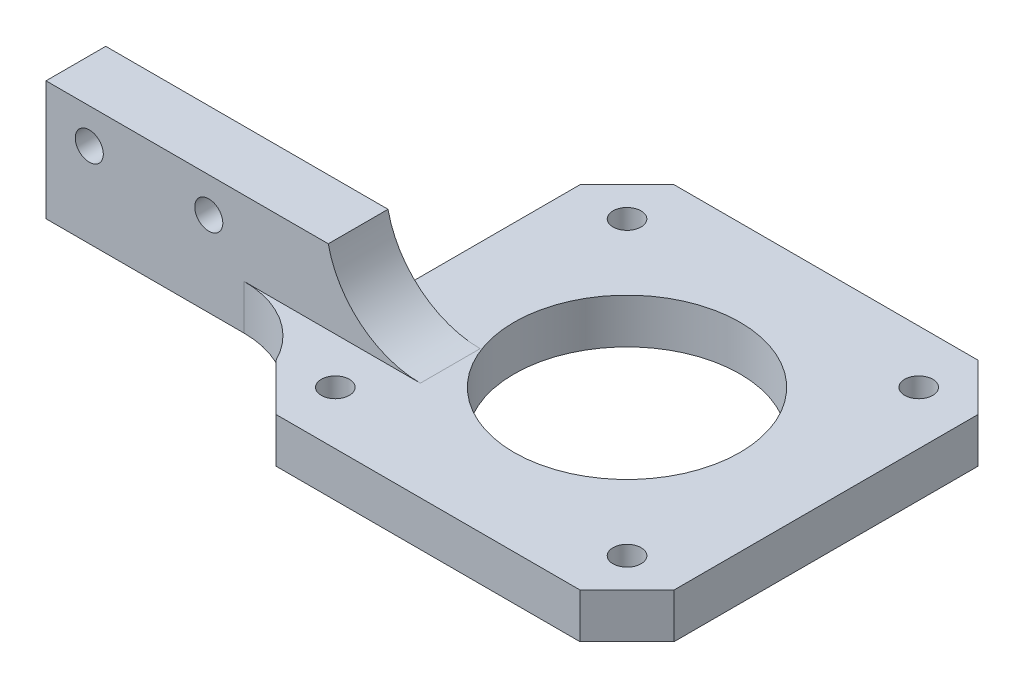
ISO-10303-21;
HEADER;
FILE_DESCRIPTION(('STEP AP214'),'2;1');
FILE_NAME('part.step','',(''),(''),'','','');
FILE_SCHEMA(('AUTOMOTIVE_DESIGN { 1 0 10303 214 1 1 1 1 }'));
ENDSEC;
DATA;
#1=APPLICATION_CONTEXT('core data for automotive mechanical design processes');
#2=APPLICATION_PROTOCOL_DEFINITION('international standard','automotive_design',2000,#1);
#3=PRODUCT_CONTEXT('',#1,'mechanical');
#4=PRODUCT('Part','Part','',(#3));
#5=PRODUCT_RELATED_PRODUCT_CATEGORY('part','',(#4));
#6=PRODUCT_DEFINITION_FORMATION('','',#4);
#7=PRODUCT_DEFINITION_CONTEXT('part definition',#1,'design');
#8=PRODUCT_DEFINITION('design','',#6,#7);
#9=PRODUCT_DEFINITION_SHAPE('','',#8);
#10=(LENGTH_UNIT() NAMED_UNIT(*) SI_UNIT(.MILLI.,.METRE.));
#11=(NAMED_UNIT(*) PLANE_ANGLE_UNIT() SI_UNIT($,.RADIAN.));
#12=(NAMED_UNIT(*) SI_UNIT($,.STERADIAN.) SOLID_ANGLE_UNIT());
#13=UNCERTAINTY_MEASURE_WITH_UNIT(LENGTH_MEASURE(1.E-05),#10,'distance_accuracy_value','');
#14=(GEOMETRIC_REPRESENTATION_CONTEXT(3) GLOBAL_UNCERTAINTY_ASSIGNED_CONTEXT((#13)) GLOBAL_UNIT_ASSIGNED_CONTEXT((#10,
#11,#12)) REPRESENTATION_CONTEXT('',''));
#15=CARTESIAN_POINT('',(0.,0.,0.));
#16=DIRECTION('',(0.,0.,1.));
#17=DIRECTION('',(1.,0.,0.));
#18=AXIS2_PLACEMENT_3D('',#15,#16,#17);
#19=CARTESIAN_POINT('',(-21.15,4.7625,-16.15));
#20=DIRECTION('',(1.,0.,0.));
#21=DIRECTION('',(0.,0.,-1.));
#22=AXIS2_PLACEMENT_3D('',#19,#20,#21);
#23=PLANE('',#22);
#24=DIRECTION('',(0.,-1.,0.));
#25=VECTOR('',#24,1.);
#26=CARTESIAN_POINT('',(-21.15,0.,4.2499999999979));
#27=LINE('',#26,#25);
#28=CARTESIAN_POINT('',(-21.15,4.7625,4.2499999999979));
#29=VERTEX_POINT('',#28);
#30=CARTESIAN_POINT('',(-21.15,0.,4.2499999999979));
#31=VERTEX_POINT('',#30);
#32=EDGE_CURVE('E174',#29,#31,#27,.T.);
#33=ORIENTED_EDGE('',*,*,#32,.F.);
#34=DIRECTION('',(0.,0.,1.));
#35=VECTOR('',#34,1.);
#36=CARTESIAN_POINT('',(-21.15,4.7625,-16.15));
#37=LINE('',#36,#35);
#38=CARTESIAN_POINT('',(-21.15,4.7625,-16.15));
#39=VERTEX_POINT('',#38);
#40=EDGE_CURVE('E223',#39,#29,#37,.T.);
#41=ORIENTED_EDGE('',*,*,#40,.F.);
#42=DIRECTION('',(0.,-1.,0.));
#43=VECTOR('',#42,1.);
#44=CARTESIAN_POINT('',(-21.15,4.7625,-16.15));
#45=LINE('',#44,#43);
#46=CARTESIAN_POINT('',(-21.15,0.,-16.15));
#47=VERTEX_POINT('',#46);
#48=EDGE_CURVE('E252',#39,#47,#45,.T.);
#49=ORIENTED_EDGE('',*,*,#48,.T.);
#50=DIRECTION('',(0.,0.,1.));
#51=VECTOR('',#50,1.);
#52=CARTESIAN_POINT('',(-21.15,0.,-16.15));
#53=LINE('',#52,#51);
#54=EDGE_CURVE('E240',#47,#31,#53,.T.);
#55=ORIENTED_EDGE('',*,*,#54,.T.);
#56=EDGE_LOOP('',(#33,#41,#49,#55));
#57=FACE_BOUND('',#56,.T.);
#58=ADVANCED_FACE('F45',(#57),#23,.F.);
#59=CARTESIAN_POINT('',(0.,4.7625,0.));
#60=DIRECTION('',(0.,1.,0.));
#61=DIRECTION('',(0.,0.,1.));
#62=AXIS2_PLACEMENT_3D('',#59,#60,#61);
#63=PLANE('',#62);
#64=CARTESIAN_POINT('',(15.5,4.7625,15.5));
#65=DIRECTION('',(0.,1.,0.));
#66=DIRECTION('',(0.,0.,1.));
#67=AXIS2_PLACEMENT_3D('',#64,#65,#66);
#68=CIRCLE('',#67,1.49);
#69=CARTESIAN_POINT('',(15.5,4.7625,14.01));
#70=VERTEX_POINT('',#69);
#71=EDGE_CURVE('E187',#70,#70,#68,.T.);
#72=ORIENTED_EDGE('',*,*,#71,.F.);
#73=EDGE_LOOP('',(#72));
#74=FACE_BOUND('',#73,.T.);
#75=CARTESIAN_POINT('',(-15.5,4.7625,-15.5));
#76=DIRECTION('',(0.,1.,0.));
#77=DIRECTION('',(0.,0.,1.));
#78=AXIS2_PLACEMENT_3D('',#75,#76,#77);
#79=CIRCLE('',#78,1.49);
#80=CARTESIAN_POINT('',(-15.5,4.7625,-16.99));
#81=VERTEX_POINT('',#80);
#82=EDGE_CURVE('E199',#81,#81,#79,.T.);
#83=ORIENTED_EDGE('',*,*,#82,.F.);
#84=EDGE_LOOP('',(#83));
#85=FACE_BOUND('',#84,.T.);
#86=DIRECTION('',(0.,0.,1.));
#87=VECTOR('',#86,1.);
#88=CARTESIAN_POINT('',(-11.3650067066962,4.7625,10.5999999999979));
#89=LINE('',#88,#87);
#90=CARTESIAN_POINT('',(-11.3650067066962,4.7625,4.2499999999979));
#91=VERTEX_POINT('',#90);
#92=CARTESIAN_POINT('',(-11.3650067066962,4.7625,10.5999999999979));
#93=VERTEX_POINT('',#92);
#94=EDGE_CURVE('E275',#91,#93,#89,.T.);
#95=ORIENTED_EDGE('',*,*,#94,.T.);
#96=DIRECTION('',(1.,0.,0.));
#97=VECTOR('',#96,1.);
#98=CARTESIAN_POINT('',(-51.15,4.7625,10.5999999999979));
#99=LINE('',#98,#97);
#100=CARTESIAN_POINT('',(-30.1053056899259,4.7625,10.5999999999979));
#101=VERTEX_POINT('',#100);
#102=EDGE_CURVE('E69',#101,#93,#99,.T.);
#103=ORIENTED_EDGE('',*,*,#102,.F.);
#104=CARTESIAN_POINT('',(-30.1053056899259,4.7625,20.5999999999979));
#105=DIRECTION('',(0.,1.,0.));
#106=DIRECTION('',(0.,0.,1.));
#107=AXIS2_PLACEMENT_3D('',#104,#105,#106);
#108=CIRCLE('',#107,10.);
#109=CARTESIAN_POINT('',(-21.15,4.7625,16.15));
#110=VERTEX_POINT('',#109);
#111=EDGE_CURVE('E270',#101,#110,#108,.F.);
#112=ORIENTED_EDGE('',*,*,#111,.T.);
#113=DIRECTION('',(0.707106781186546,0.,0.707106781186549));
#114=VECTOR('',#113,1.);
#115=CARTESIAN_POINT('',(-21.15,4.7625,16.15));
#116=LINE('',#115,#114);
#117=CARTESIAN_POINT('',(-16.15,4.7625,21.15));
#118=VERTEX_POINT('',#117);
#119=EDGE_CURVE('E225',#110,#118,#116,.T.);
#120=ORIENTED_EDGE('',*,*,#119,.T.);
#121=DIRECTION('',(1.,0.,0.));
#122=VECTOR('',#121,1.);
#123=CARTESIAN_POINT('',(-16.15,4.7625,21.15));
#124=LINE('',#123,#122);
#125=CARTESIAN_POINT('',(16.15,4.7625,21.15));
#126=VERTEX_POINT('',#125);
#127=EDGE_CURVE('E227',#118,#126,#124,.T.);
#128=ORIENTED_EDGE('',*,*,#127,.T.);
#129=DIRECTION('',(0.707106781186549,0.,-0.707106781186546));
#130=VECTOR('',#129,1.);
#131=CARTESIAN_POINT('',(16.15,4.7625,21.15));
#132=LINE('',#131,#130);
#133=CARTESIAN_POINT('',(21.15,4.7625,16.15));
#134=VERTEX_POINT('',#133);
#135=EDGE_CURVE('E211',#126,#134,#132,.T.);
#136=ORIENTED_EDGE('',*,*,#135,.T.);
#137=DIRECTION('',(0.,0.,-1.));
#138=VECTOR('',#137,1.);
#139=CARTESIAN_POINT('',(21.15,4.7625,16.15));
#140=LINE('',#139,#138);
#141=CARTESIAN_POINT('',(21.15,4.7625,-16.15));
#142=VERTEX_POINT('',#141);
#143=EDGE_CURVE('E214',#134,#142,#140,.T.);
#144=ORIENTED_EDGE('',*,*,#143,.T.);
#145=DIRECTION('',(-0.707106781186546,0.,-0.707106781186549));
#146=VECTOR('',#145,1.);
#147=CARTESIAN_POINT('',(21.15,4.7625,-16.15));
#148=LINE('',#147,#146);
#149=CARTESIAN_POINT('',(16.15,4.7625,-21.15));
#150=VERTEX_POINT('',#149);
#151=EDGE_CURVE('E217',#142,#150,#148,.T.);
#152=ORIENTED_EDGE('',*,*,#151,.T.);
#153=DIRECTION('',(-1.,0.,0.));
#154=VECTOR('',#153,1.);
#155=CARTESIAN_POINT('',(16.15,4.7625,-21.15));
#156=LINE('',#155,#154);
#157=CARTESIAN_POINT('',(-16.15,4.7625,-21.15));
#158=VERTEX_POINT('',#157);
#159=EDGE_CURVE('E219',#150,#158,#156,.T.);
#160=ORIENTED_EDGE('',*,*,#159,.T.);
#161=DIRECTION('',(-0.707106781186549,0.,0.707106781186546));
#162=VECTOR('',#161,1.);
#163=CARTESIAN_POINT('',(-16.15,4.7625,-21.15));
#164=LINE('',#163,#162);
#165=EDGE_CURVE('E221',#158,#39,#164,.T.);
#166=ORIENTED_EDGE('',*,*,#165,.T.);
#167=ORIENTED_EDGE('',*,*,#40,.T.);
#168=DIRECTION('',(1.,0.,0.));
#169=VECTOR('',#168,1.);
#170=CARTESIAN_POINT('',(0.,4.7625,4.2499999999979));
#171=LINE('',#170,#169);
#172=EDGE_CURVE('E61',#29,#91,#171,.T.);
#173=ORIENTED_EDGE('',*,*,#172,.T.);
#174=EDGE_LOOP('',(#95,#103,#112,#120,#128,#136,#144,#152,#160,#166,#167,#173));
#175=FACE_BOUND('',#174,.T.);
#176=CARTESIAN_POINT('',(0.,4.7625,0.));
#177=DIRECTION('',(0.,1.,0.));
#178=DIRECTION('',(0.,0.,1.));
#179=AXIS2_PLACEMENT_3D('',#176,#177,#178);
#180=CIRCLE('',#179,12.);
#181=CARTESIAN_POINT('',(0.,4.7625,-12.));
#182=VERTEX_POINT('',#181);
#183=EDGE_CURVE('E205',#182,#182,#180,.T.);
#184=ORIENTED_EDGE('',*,*,#183,.F.);
#185=EDGE_LOOP('',(#184));
#186=FACE_BOUND('',#185,.T.);
#187=CARTESIAN_POINT('',(15.5,4.7625,-15.5));
#188=DIRECTION('',(0.,1.,0.));
#189=DIRECTION('',(0.,0.,1.));
#190=AXIS2_PLACEMENT_3D('',#187,#188,#189);
#191=CIRCLE('',#190,1.49);
#192=CARTESIAN_POINT('',(15.5,4.7625,-16.99));
#193=VERTEX_POINT('',#192);
#194=EDGE_CURVE('E193',#193,#193,#191,.T.);
#195=ORIENTED_EDGE('',*,*,#194,.F.);
#196=EDGE_LOOP('',(#195));
#197=FACE_BOUND('',#196,.T.);
#198=CARTESIAN_POINT('',(-15.5,4.7625,15.5));
#199=DIRECTION('',(0.,1.,0.));
#200=DIRECTION('',(0.,0.,1.));
#201=AXIS2_PLACEMENT_3D('',#198,#199,#200);
#202=CIRCLE('',#201,1.49);
#203=CARTESIAN_POINT('',(-15.5,4.7625,14.01));
#204=VERTEX_POINT('',#203);
#205=EDGE_CURVE('E178',#204,#204,#202,.T.);
#206=ORIENTED_EDGE('',*,*,#205,.F.);
#207=EDGE_LOOP('',(#206));
#208=FACE_BOUND('',#207,.T.);
#209=ADVANCED_FACE('F306',(#74,#85,#175,#186,#197,#208),#63,.T.);
#210=CARTESIAN_POINT('',(0.,0.,0.));
#211=DIRECTION('',(0.,1.,0.));
#212=DIRECTION('',(0.,0.,1.));
#213=AXIS2_PLACEMENT_3D('',#210,#211,#212);
#214=PLANE('',#213);
#215=DIRECTION('',(0.707106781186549,0.,-0.707106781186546));
#216=VECTOR('',#215,1.);
#217=CARTESIAN_POINT('',(16.15,0.,21.15));
#218=LINE('',#217,#216);
#219=CARTESIAN_POINT('',(16.15,0.,21.15));
#220=VERTEX_POINT('',#219);
#221=CARTESIAN_POINT('',(21.15,0.,16.15));
#222=VERTEX_POINT('',#221);
#223=EDGE_CURVE('E208',#220,#222,#218,.T.);
#224=ORIENTED_EDGE('',*,*,#223,.F.);
#225=DIRECTION('',(1.,0.,0.));
#226=VECTOR('',#225,1.);
#227=CARTESIAN_POINT('',(-16.15,0.,21.15));
#228=LINE('',#227,#226);
#229=CARTESIAN_POINT('',(-16.15,0.,21.15));
#230=VERTEX_POINT('',#229);
#231=EDGE_CURVE('E215',#230,#220,#228,.T.);
#232=ORIENTED_EDGE('',*,*,#231,.F.);
#233=DIRECTION('',(0.707106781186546,0.,0.707106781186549));
#234=VECTOR('',#233,1.);
#235=CARTESIAN_POINT('',(-21.15,0.,16.15));
#236=LINE('',#235,#234);
#237=CARTESIAN_POINT('',(-21.15,0.,16.15));
#238=VERTEX_POINT('',#237);
#239=EDGE_CURVE('E242',#238,#230,#236,.T.);
#240=ORIENTED_EDGE('',*,*,#239,.F.);
#241=CARTESIAN_POINT('',(-30.1053056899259,0.,20.5999999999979));
#242=DIRECTION('',(0.,1.,0.));
#243=DIRECTION('',(0.,0.,1.));
#244=AXIS2_PLACEMENT_3D('',#241,#242,#243);
#245=CIRCLE('',#244,10.);
#246=CARTESIAN_POINT('',(-30.1053056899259,0.,10.5999999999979));
#247=VERTEX_POINT('',#246);
#248=EDGE_CURVE('E272',#238,#247,#245,.T.);
#249=ORIENTED_EDGE('',*,*,#248,.T.);
#250=DIRECTION('',(1.,0.,0.));
#251=VECTOR('',#250,1.);
#252=CARTESIAN_POINT('',(-51.15,0.,10.5999999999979));
#253=LINE('',#252,#251);
#254=CARTESIAN_POINT('',(-51.15,0.,10.5999999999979));
#255=VERTEX_POINT('',#254);
#256=EDGE_CURVE('E158',#255,#247,#253,.T.);
#257=ORIENTED_EDGE('',*,*,#256,.F.);
#258=DIRECTION('',(0.,0.,1.));
#259=VECTOR('',#258,1.);
#260=CARTESIAN_POINT('',(-51.15,0.,4.2499999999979));
#261=LINE('',#260,#259);
#262=CARTESIAN_POINT('',(-51.15,0.,4.2499999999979));
#263=VERTEX_POINT('',#262);
#264=EDGE_CURVE('E149',#263,#255,#261,.T.);
#265=ORIENTED_EDGE('',*,*,#264,.F.);
#266=DIRECTION('',(1.,0.,0.));
#267=VECTOR('',#266,1.);
#268=CARTESIAN_POINT('',(-51.15,0.,4.2499999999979));
#269=LINE('',#268,#267);
#270=EDGE_CURVE('E156',#263,#31,#269,.T.);
#271=ORIENTED_EDGE('',*,*,#270,.T.);
#272=ORIENTED_EDGE('',*,*,#54,.F.);
#273=DIRECTION('',(-0.707106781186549,0.,0.707106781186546));
#274=VECTOR('',#273,1.);
#275=CARTESIAN_POINT('',(-16.15,0.,-21.15));
#276=LINE('',#275,#274);
#277=CARTESIAN_POINT('',(-16.15,0.,-21.15));
#278=VERTEX_POINT('',#277);
#279=EDGE_CURVE('E238',#278,#47,#276,.T.);
#280=ORIENTED_EDGE('',*,*,#279,.F.);
#281=DIRECTION('',(-1.,0.,0.));
#282=VECTOR('',#281,1.);
#283=CARTESIAN_POINT('',(16.15,0.,-21.15));
#284=LINE('',#283,#282);
#285=CARTESIAN_POINT('',(16.15,0.,-21.15));
#286=VERTEX_POINT('',#285);
#287=EDGE_CURVE('E236',#286,#278,#284,.T.);
#288=ORIENTED_EDGE('',*,*,#287,.F.);
#289=DIRECTION('',(-0.707106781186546,0.,-0.707106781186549));
#290=VECTOR('',#289,1.);
#291=CARTESIAN_POINT('',(21.15,0.,-16.15));
#292=LINE('',#291,#290);
#293=CARTESIAN_POINT('',(21.15,0.,-16.15));
#294=VERTEX_POINT('',#293);
#295=EDGE_CURVE('E234',#294,#286,#292,.T.);
#296=ORIENTED_EDGE('',*,*,#295,.F.);
#297=DIRECTION('',(0.,0.,-1.));
#298=VECTOR('',#297,1.);
#299=CARTESIAN_POINT('',(21.15,0.,16.15));
#300=LINE('',#299,#298);
#301=EDGE_CURVE('E232',#222,#294,#300,.T.);
#302=ORIENTED_EDGE('',*,*,#301,.F.);
#303=EDGE_LOOP('',(#224,#232,#240,#249,#257,#265,#271,#272,#280,#288,#296,#302));
#304=FACE_BOUND('',#303,.T.);
#305=CARTESIAN_POINT('',(0.,0.,0.));
#306=DIRECTION('',(0.,1.,0.));
#307=DIRECTION('',(0.,0.,1.));
#308=AXIS2_PLACEMENT_3D('',#305,#306,#307);
#309=CIRCLE('',#308,12.);
#310=CARTESIAN_POINT('',(0.,0.,-12.));
#311=VERTEX_POINT('',#310);
#312=EDGE_CURVE('E202',#311,#311,#309,.T.);
#313=ORIENTED_EDGE('',*,*,#312,.T.);
#314=EDGE_LOOP('',(#313));
#315=FACE_BOUND('',#314,.T.);
#316=CARTESIAN_POINT('',(-15.5,0.,-15.5));
#317=DIRECTION('',(0.,1.,0.));
#318=DIRECTION('',(0.,0.,1.));
#319=AXIS2_PLACEMENT_3D('',#316,#317,#318);
#320=CIRCLE('',#319,1.49);
#321=CARTESIAN_POINT('',(-15.5,0.,-16.99));
#322=VERTEX_POINT('',#321);
#323=EDGE_CURVE('E196',#322,#322,#320,.T.);
#324=ORIENTED_EDGE('',*,*,#323,.T.);
#325=EDGE_LOOP('',(#324));
#326=FACE_BOUND('',#325,.T.);
#327=CARTESIAN_POINT('',(15.5,0.,-15.5));
#328=DIRECTION('',(0.,1.,0.));
#329=DIRECTION('',(0.,0.,1.));
#330=AXIS2_PLACEMENT_3D('',#327,#328,#329);
#331=CIRCLE('',#330,1.49);
#332=CARTESIAN_POINT('',(15.5,0.,-16.99));
#333=VERTEX_POINT('',#332);
#334=EDGE_CURVE('E190',#333,#333,#331,.T.);
#335=ORIENTED_EDGE('',*,*,#334,.T.);
#336=EDGE_LOOP('',(#335));
#337=FACE_BOUND('',#336,.T.);
#338=CARTESIAN_POINT('',(15.5,0.,15.5));
#339=DIRECTION('',(0.,1.,0.));
#340=DIRECTION('',(0.,0.,1.));
#341=AXIS2_PLACEMENT_3D('',#338,#339,#340);
#342=CIRCLE('',#341,1.49);
#343=CARTESIAN_POINT('',(15.5,0.,14.01));
#344=VERTEX_POINT('',#343);
#345=EDGE_CURVE('E185',#344,#344,#342,.T.);
#346=ORIENTED_EDGE('',*,*,#345,.T.);
#347=EDGE_LOOP('',(#346));
#348=FACE_BOUND('',#347,.T.);
#349=CARTESIAN_POINT('',(-15.5,0.,15.5));
#350=DIRECTION('',(0.,1.,0.));
#351=DIRECTION('',(0.,0.,1.));
#352=AXIS2_PLACEMENT_3D('',#349,#350,#351);
#353=CIRCLE('',#352,1.49);
#354=CARTESIAN_POINT('',(-15.5,0.,14.01));
#355=VERTEX_POINT('',#354);
#356=EDGE_CURVE('E175',#355,#355,#353,.T.);
#357=ORIENTED_EDGE('',*,*,#356,.T.);
#358=EDGE_LOOP('',(#357));
#359=FACE_BOUND('',#358,.T.);
#360=ADVANCED_FACE('F152',(#304,#315,#326,#337,#348,#359),#214,.F.);
#361=CARTESIAN_POINT('',(16.15,4.7625,21.15));
#362=DIRECTION('',(-0.707106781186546,0.,-0.707106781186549));
#363=DIRECTION('',(-0.707106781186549,0.,0.707106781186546));
#364=AXIS2_PLACEMENT_3D('',#361,#362,#363);
#365=PLANE('',#364);
#366=ORIENTED_EDGE('',*,*,#223,.T.);
#367=DIRECTION('',(0.,-1.,0.));
#368=VECTOR('',#367,1.);
#369=CARTESIAN_POINT('',(21.15,4.7625,16.15));
#370=LINE('',#369,#368);
#371=EDGE_CURVE('E264',#134,#222,#370,.T.);
#372=ORIENTED_EDGE('',*,*,#371,.F.);
#373=ORIENTED_EDGE('',*,*,#135,.F.);
#374=DIRECTION('',(0.,-1.,0.));
#375=VECTOR('',#374,1.);
#376=CARTESIAN_POINT('',(16.15,4.7625,21.15));
#377=LINE('',#376,#375);
#378=EDGE_CURVE('E229',#126,#220,#377,.T.);
#379=ORIENTED_EDGE('',*,*,#378,.T.);
#380=EDGE_LOOP('',(#366,#372,#373,#379));
#381=FACE_BOUND('',#380,.T.);
#382=ADVANCED_FACE('F332',(#381),#365,.F.);
#383=CARTESIAN_POINT('',(21.15,4.7625,16.15));
#384=DIRECTION('',(-1.,0.,0.));
#385=DIRECTION('',(0.,0.,1.));
#386=AXIS2_PLACEMENT_3D('',#383,#384,#385);
#387=PLANE('',#386);
#388=ORIENTED_EDGE('',*,*,#301,.T.);
#389=DIRECTION('',(0.,-1.,0.));
#390=VECTOR('',#389,1.);
#391=CARTESIAN_POINT('',(21.15,4.7625,-16.15));
#392=LINE('',#391,#390);
#393=EDGE_CURVE('E261',#142,#294,#392,.T.);
#394=ORIENTED_EDGE('',*,*,#393,.F.);
#395=ORIENTED_EDGE('',*,*,#143,.F.);
#396=ORIENTED_EDGE('',*,*,#371,.T.);
#397=EDGE_LOOP('',(#388,#394,#395,#396));
#398=FACE_BOUND('',#397,.T.);
#399=ADVANCED_FACE('F329',(#398),#387,.F.);
#400=CARTESIAN_POINT('',(21.15,4.7625,-16.15));
#401=DIRECTION('',(-0.707106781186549,0.,0.707106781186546));
#402=DIRECTION('',(0.707106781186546,0.,0.707106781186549));
#403=AXIS2_PLACEMENT_3D('',#400,#401,#402);
#404=PLANE('',#403);
#405=ORIENTED_EDGE('',*,*,#295,.T.);
#406=DIRECTION('',(0.,-1.,0.));
#407=VECTOR('',#406,1.);
#408=CARTESIAN_POINT('',(16.15,4.7625,-21.15));
#409=LINE('',#408,#407);
#410=EDGE_CURVE('E258',#150,#286,#409,.T.);
#411=ORIENTED_EDGE('',*,*,#410,.F.);
#412=ORIENTED_EDGE('',*,*,#151,.F.);
#413=ORIENTED_EDGE('',*,*,#393,.T.);
#414=EDGE_LOOP('',(#405,#411,#412,#413));
#415=FACE_BOUND('',#414,.T.);
#416=ADVANCED_FACE('F324',(#415),#404,.F.);
#417=CARTESIAN_POINT('',(16.15,4.7625,-21.15));
#418=DIRECTION('',(0.,0.,1.));
#419=DIRECTION('',(1.,0.,0.));
#420=AXIS2_PLACEMENT_3D('',#417,#418,#419);
#421=PLANE('',#420);
#422=ORIENTED_EDGE('',*,*,#287,.T.);
#423=DIRECTION('',(0.,-1.,0.));
#424=VECTOR('',#423,1.);
#425=CARTESIAN_POINT('',(-16.15,4.7625,-21.15));
#426=LINE('',#425,#424);
#427=EDGE_CURVE('E255',#158,#278,#426,.T.);
#428=ORIENTED_EDGE('',*,*,#427,.F.);
#429=ORIENTED_EDGE('',*,*,#159,.F.);
#430=ORIENTED_EDGE('',*,*,#410,.T.);
#431=EDGE_LOOP('',(#422,#428,#429,#430));
#432=FACE_BOUND('',#431,.T.);
#433=ADVANCED_FACE('F320',(#432),#421,.F.);
#434=CARTESIAN_POINT('',(-16.15,4.7625,-21.15));
#435=DIRECTION('',(0.707106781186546,0.,0.707106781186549));
#436=DIRECTION('',(0.707106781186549,0.,-0.707106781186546));
#437=AXIS2_PLACEMENT_3D('',#434,#435,#436);
#438=PLANE('',#437);
#439=ORIENTED_EDGE('',*,*,#279,.T.);
#440=ORIENTED_EDGE('',*,*,#48,.F.);
#441=ORIENTED_EDGE('',*,*,#165,.F.);
#442=ORIENTED_EDGE('',*,*,#427,.T.);
#443=EDGE_LOOP('',(#439,#440,#441,#442));
#444=FACE_BOUND('',#443,.T.);
#445=ADVANCED_FACE('F316',(#444),#438,.F.);
#446=CARTESIAN_POINT('',(-21.15,4.7625,16.15));
#447=DIRECTION('',(0.707106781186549,0.,-0.707106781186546));
#448=DIRECTION('',(-0.707106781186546,0.,-0.707106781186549));
#449=AXIS2_PLACEMENT_3D('',#446,#447,#448);
#450=PLANE('',#449);
#451=ORIENTED_EDGE('',*,*,#239,.T.);
#452=DIRECTION('',(0.,-1.,0.));
#453=VECTOR('',#452,1.);
#454=CARTESIAN_POINT('',(-16.15,4.7625,21.15));
#455=LINE('',#454,#453);
#456=EDGE_CURVE('E247',#118,#230,#455,.T.);
#457=ORIENTED_EDGE('',*,*,#456,.F.);
#458=ORIENTED_EDGE('',*,*,#119,.F.);
#459=DIRECTION('',(0.,-1.,0.));
#460=VECTOR('',#459,1.);
#461=CARTESIAN_POINT('',(-21.15,4.7625,16.15));
#462=LINE('',#461,#460);
#463=EDGE_CURVE('E250',#110,#238,#462,.T.);
#464=ORIENTED_EDGE('',*,*,#463,.T.);
#465=EDGE_LOOP('',(#451,#457,#458,#464));
#466=FACE_BOUND('',#465,.T.);
#467=ADVANCED_FACE('F369',(#466),#450,.F.);
#468=CARTESIAN_POINT('',(-16.15,4.7625,21.15));
#469=DIRECTION('',(0.,0.,-1.));
#470=DIRECTION('',(-1.,0.,0.));
#471=AXIS2_PLACEMENT_3D('',#468,#469,#470);
#472=PLANE('',#471);
#473=ORIENTED_EDGE('',*,*,#231,.T.);
#474=ORIENTED_EDGE('',*,*,#378,.F.);
#475=ORIENTED_EDGE('',*,*,#127,.F.);
#476=ORIENTED_EDGE('',*,*,#456,.T.);
#477=EDGE_LOOP('',(#473,#474,#475,#476));
#478=FACE_BOUND('',#477,.T.);
#479=ADVANCED_FACE('F336',(#478),#472,.F.);
#480=CARTESIAN_POINT('',(0.,4.7625,0.));
#481=DIRECTION('',(0.,-1.,0.));
#482=DIRECTION('',(0.,0.,-1.));
#483=AXIS2_PLACEMENT_3D('',#480,#481,#482);
#484=CYLINDRICAL_SURFACE('',#483,12.);
#485=CARTESIAN_POINT('',(0.,4.7625,-12.));
#486=CARTESIAN_POINT('',(0.,4.712890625,-12.));
#487=CARTESIAN_POINT('',(0.,4.66328125,-12.));
#488=CARTESIAN_POINT('',(0.,4.5640625,-12.));
#489=CARTESIAN_POINT('',(0.,4.514453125,-12.));
#490=CARTESIAN_POINT('',(0.,4.415234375,-12.));
#491=CARTESIAN_POINT('',(0.,4.365625,-12.));
#492=CARTESIAN_POINT('',(0.,4.26640625,-12.));
#493=CARTESIAN_POINT('',(0.,4.216796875,-12.));
#494=CARTESIAN_POINT('',(0.,4.117578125,-12.));
#495=CARTESIAN_POINT('',(0.,4.06796875,-12.));
#496=CARTESIAN_POINT('',(0.,3.96875,-12.));
#497=CARTESIAN_POINT('',(0.,3.919140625,-12.));
#498=CARTESIAN_POINT('',(0.,3.819921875,-12.));
#499=CARTESIAN_POINT('',(0.,3.7703125,-12.));
#500=CARTESIAN_POINT('',(0.,3.67109375,-12.));
#501=CARTESIAN_POINT('',(0.,3.621484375,-12.));
#502=CARTESIAN_POINT('',(0.,3.522265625,-12.));
#503=CARTESIAN_POINT('',(0.,3.47265625,-12.));
#504=CARTESIAN_POINT('',(0.,3.3734375,-12.));
#505=CARTESIAN_POINT('',(0.,3.323828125,-12.));
#506=CARTESIAN_POINT('',(0.,3.224609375,-12.));
#507=CARTESIAN_POINT('',(0.,3.175,-12.));
#508=CARTESIAN_POINT('',(0.,3.07578125,-12.));
#509=CARTESIAN_POINT('',(0.,3.026171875,-12.));
#510=CARTESIAN_POINT('',(0.,2.926953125,-12.));
#511=CARTESIAN_POINT('',(0.,2.87734375,-12.));
#512=CARTESIAN_POINT('',(0.,2.778125,-12.));
#513=CARTESIAN_POINT('',(0.,2.728515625,-12.));
#514=CARTESIAN_POINT('',(0.,2.629296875,-12.));
#515=CARTESIAN_POINT('',(0.,2.5796875,-12.));
#516=CARTESIAN_POINT('',(0.,2.48046875,-12.));
#517=CARTESIAN_POINT('',(0.,2.430859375,-12.));
#518=CARTESIAN_POINT('',(0.,2.331640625,-12.));
#519=CARTESIAN_POINT('',(0.,2.28203125,-12.));
#520=CARTESIAN_POINT('',(0.,2.1828125,-12.));
#521=CARTESIAN_POINT('',(0.,2.133203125,-12.));
#522=CARTESIAN_POINT('',(0.,2.033984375,-12.));
#523=CARTESIAN_POINT('',(0.,1.984375,-12.));
#524=CARTESIAN_POINT('',(0.,1.88515625,-12.));
#525=CARTESIAN_POINT('',(0.,1.835546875,-12.));
#526=CARTESIAN_POINT('',(0.,1.736328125,-12.));
#527=CARTESIAN_POINT('',(0.,1.68671875,-12.));
#528=CARTESIAN_POINT('',(0.,1.5875,-12.));
#529=CARTESIAN_POINT('',(0.,1.537890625,-12.));
#530=CARTESIAN_POINT('',(0.,1.438671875,-12.));
#531=CARTESIAN_POINT('',(0.,1.3890625,-12.));
#532=CARTESIAN_POINT('',(0.,1.28984375,-12.));
#533=CARTESIAN_POINT('',(0.,1.240234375,-12.));
#534=CARTESIAN_POINT('',(0.,1.141015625,-12.));
#535=CARTESIAN_POINT('',(0.,1.09140625,-12.));
#536=CARTESIAN_POINT('',(0.,0.992187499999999,-12.));
#537=CARTESIAN_POINT('',(0.,0.942578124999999,-12.));
#538=CARTESIAN_POINT('',(0.,0.843359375,-12.));
#539=CARTESIAN_POINT('',(0.,0.79375,-12.));
#540=CARTESIAN_POINT('',(0.,0.69453125,-12.));
#541=CARTESIAN_POINT('',(0.,0.644921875,-12.));
#542=CARTESIAN_POINT('',(0.,0.545703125,-12.));
#543=CARTESIAN_POINT('',(0.,0.49609375,-12.));
#544=CARTESIAN_POINT('',(0.,0.396875,-12.));
#545=CARTESIAN_POINT('',(0.,0.347265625,-12.));
#546=CARTESIAN_POINT('',(0.,0.248046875,-12.));
#547=CARTESIAN_POINT('',(0.,0.1984375,-12.));
#548=CARTESIAN_POINT('',(0.,0.09921875,-12.));
#549=CARTESIAN_POINT('',(0.,0.049609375,-12.));
#550=CARTESIAN_POINT('',(0.,0.,-12.));
#551=B_SPLINE_CURVE_WITH_KNOTS('',3,(#485,#486,#487,#488,#489,#490,#491,#492,#493,#494,#495,
#496,#497,#498,#499,#500,#501,#502,#503,#504,#505,#506,#507,#508,#509,#510,#511,#512,#513,#514,
#515,#516,#517,#518,#519,#520,#521,#522,#523,#524,#525,#526,#527,#528,#529,#530,#531,#532,#533,
#534,#535,#536,#537,#538,#539,#540,#541,#542,#543,#544,#545,#546,#547,#548,#549,#550),
.UNSPECIFIED.,.F.,.F.,(4,2,2,2,2,2,2,2,2,2,2,2,2,2,2,2,2,2,2,2,2,2,2,2,2,2,2,2,2,2,2,2,4),(0.,
0.148828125,0.29765625,0.446484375,0.5953125,0.744140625,0.892968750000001,1.041796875,1.190625,
1.339453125,1.48828125,1.637109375,1.7859375,1.934765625,2.08359375,2.232421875,2.38125,
2.530078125,2.67890625,2.827734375,2.9765625,3.125390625,3.27421875,3.423046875,3.571875,
3.720703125,3.86953125,4.018359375,4.1671875,4.316015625,4.46484375,4.613671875,4.7625),.UNSPECIFIED.);
#552=EDGE_CURVE('BSEAM490',#182,#311,#551,.T.);
#553=ORIENTED_EDGE('',*,*,#183,.T.);
#554=ORIENTED_EDGE('',*,*,#312,.F.);
#555=ORIENTED_EDGE('',*,*,#552,.T.);
#556=ORIENTED_EDGE('',*,*,#552,.F.);
#557=EDGE_LOOP('',(#553,#555,#554,#556));
#558=FACE_BOUND('',#557,.T.);
#559=ADVANCED_FACE('F490',(#558),#484,.F.);
#560=CARTESIAN_POINT('',(-15.5,4.7625,-15.5));
#561=DIRECTION('',(0.,-1.,0.));
#562=DIRECTION('',(0.,0.,-1.));
#563=AXIS2_PLACEMENT_3D('',#560,#561,#562);
#564=CYLINDRICAL_SURFACE('',#563,1.49);
#565=CARTESIAN_POINT('',(-15.5,4.7625,-16.99));
#566=CARTESIAN_POINT('',(-15.5,4.712890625,-16.99));
#567=CARTESIAN_POINT('',(-15.5,4.66328125,-16.99));
#568=CARTESIAN_POINT('',(-15.5,4.5640625,-16.99));
#569=CARTESIAN_POINT('',(-15.5,4.514453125,-16.99));
#570=CARTESIAN_POINT('',(-15.5,4.415234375,-16.99));
#571=CARTESIAN_POINT('',(-15.5,4.365625,-16.99));
#572=CARTESIAN_POINT('',(-15.5,4.26640625,-16.99));
#573=CARTESIAN_POINT('',(-15.5,4.216796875,-16.99));
#574=CARTESIAN_POINT('',(-15.5,4.117578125,-16.99));
#575=CARTESIAN_POINT('',(-15.5,4.06796875,-16.99));
#576=CARTESIAN_POINT('',(-15.5,3.96875,-16.99));
#577=CARTESIAN_POINT('',(-15.5,3.919140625,-16.99));
#578=CARTESIAN_POINT('',(-15.5,3.819921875,-16.99));
#579=CARTESIAN_POINT('',(-15.5,3.7703125,-16.99));
#580=CARTESIAN_POINT('',(-15.5,3.67109375,-16.99));
#581=CARTESIAN_POINT('',(-15.5,3.621484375,-16.99));
#582=CARTESIAN_POINT('',(-15.5,3.522265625,-16.99));
#583=CARTESIAN_POINT('',(-15.5,3.47265625,-16.99));
#584=CARTESIAN_POINT('',(-15.5,3.3734375,-16.99));
#585=CARTESIAN_POINT('',(-15.5,3.323828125,-16.99));
#586=CARTESIAN_POINT('',(-15.5,3.224609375,-16.99));
#587=CARTESIAN_POINT('',(-15.5,3.175,-16.99));
#588=CARTESIAN_POINT('',(-15.5,3.07578125,-16.99));
#589=CARTESIAN_POINT('',(-15.5,3.026171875,-16.99));
#590=CARTESIAN_POINT('',(-15.5,2.926953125,-16.99));
#591=CARTESIAN_POINT('',(-15.5,2.87734375,-16.99));
#592=CARTESIAN_POINT('',(-15.5,2.778125,-16.99));
#593=CARTESIAN_POINT('',(-15.5,2.728515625,-16.99));
#594=CARTESIAN_POINT('',(-15.5,2.629296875,-16.99));
#595=CARTESIAN_POINT('',(-15.5,2.5796875,-16.99));
#596=CARTESIAN_POINT('',(-15.5,2.48046875,-16.99));
#597=CARTESIAN_POINT('',(-15.5,2.430859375,-16.99));
#598=CARTESIAN_POINT('',(-15.5,2.331640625,-16.99));
#599=CARTESIAN_POINT('',(-15.5,2.28203125,-16.99));
#600=CARTESIAN_POINT('',(-15.5,2.1828125,-16.99));
#601=CARTESIAN_POINT('',(-15.5,2.133203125,-16.99));
#602=CARTESIAN_POINT('',(-15.5,2.033984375,-16.99));
#603=CARTESIAN_POINT('',(-15.5,1.984375,-16.99));
#604=CARTESIAN_POINT('',(-15.5,1.88515625,-16.99));
#605=CARTESIAN_POINT('',(-15.5,1.835546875,-16.99));
#606=CARTESIAN_POINT('',(-15.5,1.736328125,-16.99));
#607=CARTESIAN_POINT('',(-15.5,1.68671875,-16.99));
#608=CARTESIAN_POINT('',(-15.5,1.5875,-16.99));
#609=CARTESIAN_POINT('',(-15.5,1.537890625,-16.99));
#610=CARTESIAN_POINT('',(-15.5,1.438671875,-16.99));
#611=CARTESIAN_POINT('',(-15.5,1.3890625,-16.99));
#612=CARTESIAN_POINT('',(-15.5,1.28984375,-16.99));
#613=CARTESIAN_POINT('',(-15.5,1.240234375,-16.99));
#614=CARTESIAN_POINT('',(-15.5,1.141015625,-16.99));
#615=CARTESIAN_POINT('',(-15.5,1.09140625,-16.99));
#616=CARTESIAN_POINT('',(-15.5,0.992187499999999,-16.99));
#617=CARTESIAN_POINT('',(-15.5,0.942578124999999,-16.99));
#618=CARTESIAN_POINT('',(-15.5,0.843359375,-16.99));
#619=CARTESIAN_POINT('',(-15.5,0.79375,-16.99));
#620=CARTESIAN_POINT('',(-15.5,0.69453125,-16.99));
#621=CARTESIAN_POINT('',(-15.5,0.644921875,-16.99));
#622=CARTESIAN_POINT('',(-15.5,0.545703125,-16.99));
#623=CARTESIAN_POINT('',(-15.5,0.49609375,-16.99));
#624=CARTESIAN_POINT('',(-15.5,0.396875,-16.99));
#625=CARTESIAN_POINT('',(-15.5,0.347265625,-16.99));
#626=CARTESIAN_POINT('',(-15.5,0.248046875,-16.99));
#627=CARTESIAN_POINT('',(-15.5,0.1984375,-16.99));
#628=CARTESIAN_POINT('',(-15.5,0.09921875,-16.99));
#629=CARTESIAN_POINT('',(-15.5,0.049609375,-16.99));
#630=CARTESIAN_POINT('',(-15.5,0.,-16.99));
#631=B_SPLINE_CURVE_WITH_KNOTS('',3,(#565,#566,#567,#568,#569,#570,#571,#572,#573,#574,#575,
#576,#577,#578,#579,#580,#581,#582,#583,#584,#585,#586,#587,#588,#589,#590,#591,#592,#593,#594,
#595,#596,#597,#598,#599,#600,#601,#602,#603,#604,#605,#606,#607,#608,#609,#610,#611,#612,#613,
#614,#615,#616,#617,#618,#619,#620,#621,#622,#623,#624,#625,#626,#627,#628,#629,#630),
.UNSPECIFIED.,.F.,.F.,(4,2,2,2,2,2,2,2,2,2,2,2,2,2,2,2,2,2,2,2,2,2,2,2,2,2,2,2,2,2,2,2,4),(0.,
0.148828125,0.29765625,0.446484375,0.5953125,0.744140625,0.892968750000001,1.041796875,1.190625,
1.339453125,1.48828125,1.637109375,1.7859375,1.934765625,2.08359375,2.232421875,2.38125,
2.530078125,2.67890625,2.827734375,2.9765625,3.125390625,3.27421875,3.423046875,3.571875,
3.720703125,3.86953125,4.018359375,4.1671875,4.316015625,4.46484375,4.613671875,4.7625),.UNSPECIFIED.);
#632=EDGE_CURVE('BSEAM480',#81,#322,#631,.T.);
#633=ORIENTED_EDGE('',*,*,#82,.T.);
#634=ORIENTED_EDGE('',*,*,#323,.F.);
#635=ORIENTED_EDGE('',*,*,#632,.T.);
#636=ORIENTED_EDGE('',*,*,#632,.F.);
#637=EDGE_LOOP('',(#633,#635,#634,#636));
#638=FACE_BOUND('',#637,.T.);
#639=ADVANCED_FACE('F480',(#638),#564,.F.);
#640=CARTESIAN_POINT('',(15.5,4.7625,-15.5));
#641=DIRECTION('',(0.,-1.,0.));
#642=DIRECTION('',(0.,0.,-1.));
#643=AXIS2_PLACEMENT_3D('',#640,#641,#642);
#644=CYLINDRICAL_SURFACE('',#643,1.49);
#645=CARTESIAN_POINT('',(15.5,4.7625,-16.99));
#646=CARTESIAN_POINT('',(15.5,4.712890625,-16.99));
#647=CARTESIAN_POINT('',(15.5,4.66328125,-16.99));
#648=CARTESIAN_POINT('',(15.5,4.5640625,-16.99));
#649=CARTESIAN_POINT('',(15.5,4.514453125,-16.99));
#650=CARTESIAN_POINT('',(15.5,4.415234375,-16.99));
#651=CARTESIAN_POINT('',(15.5,4.365625,-16.99));
#652=CARTESIAN_POINT('',(15.5,4.26640625,-16.99));
#653=CARTESIAN_POINT('',(15.5,4.216796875,-16.99));
#654=CARTESIAN_POINT('',(15.5,4.117578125,-16.99));
#655=CARTESIAN_POINT('',(15.5,4.06796875,-16.99));
#656=CARTESIAN_POINT('',(15.5,3.96875,-16.99));
#657=CARTESIAN_POINT('',(15.5,3.919140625,-16.99));
#658=CARTESIAN_POINT('',(15.5,3.819921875,-16.99));
#659=CARTESIAN_POINT('',(15.5,3.7703125,-16.99));
#660=CARTESIAN_POINT('',(15.5,3.67109375,-16.99));
#661=CARTESIAN_POINT('',(15.5,3.621484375,-16.99));
#662=CARTESIAN_POINT('',(15.5,3.522265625,-16.99));
#663=CARTESIAN_POINT('',(15.5,3.47265625,-16.99));
#664=CARTESIAN_POINT('',(15.5,3.3734375,-16.99));
#665=CARTESIAN_POINT('',(15.5,3.323828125,-16.99));
#666=CARTESIAN_POINT('',(15.5,3.224609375,-16.99));
#667=CARTESIAN_POINT('',(15.5,3.175,-16.99));
#668=CARTESIAN_POINT('',(15.5,3.07578125,-16.99));
#669=CARTESIAN_POINT('',(15.5,3.026171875,-16.99));
#670=CARTESIAN_POINT('',(15.5,2.926953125,-16.99));
#671=CARTESIAN_POINT('',(15.5,2.87734375,-16.99));
#672=CARTESIAN_POINT('',(15.5,2.778125,-16.99));
#673=CARTESIAN_POINT('',(15.5,2.728515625,-16.99));
#674=CARTESIAN_POINT('',(15.5,2.629296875,-16.99));
#675=CARTESIAN_POINT('',(15.5,2.5796875,-16.99));
#676=CARTESIAN_POINT('',(15.5,2.48046875,-16.99));
#677=CARTESIAN_POINT('',(15.5,2.430859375,-16.99));
#678=CARTESIAN_POINT('',(15.5,2.331640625,-16.99));
#679=CARTESIAN_POINT('',(15.5,2.28203125,-16.99));
#680=CARTESIAN_POINT('',(15.5,2.1828125,-16.99));
#681=CARTESIAN_POINT('',(15.5,2.133203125,-16.99));
#682=CARTESIAN_POINT('',(15.5,2.033984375,-16.99));
#683=CARTESIAN_POINT('',(15.5,1.984375,-16.99));
#684=CARTESIAN_POINT('',(15.5,1.88515625,-16.99));
#685=CARTESIAN_POINT('',(15.5,1.835546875,-16.99));
#686=CARTESIAN_POINT('',(15.5,1.736328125,-16.99));
#687=CARTESIAN_POINT('',(15.5,1.68671875,-16.99));
#688=CARTESIAN_POINT('',(15.5,1.5875,-16.99));
#689=CARTESIAN_POINT('',(15.5,1.537890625,-16.99));
#690=CARTESIAN_POINT('',(15.5,1.438671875,-16.99));
#691=CARTESIAN_POINT('',(15.5,1.3890625,-16.99));
#692=CARTESIAN_POINT('',(15.5,1.28984375,-16.99));
#693=CARTESIAN_POINT('',(15.5,1.240234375,-16.99));
#694=CARTESIAN_POINT('',(15.5,1.141015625,-16.99));
#695=CARTESIAN_POINT('',(15.5,1.09140625,-16.99));
#696=CARTESIAN_POINT('',(15.5,0.992187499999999,-16.99));
#697=CARTESIAN_POINT('',(15.5,0.942578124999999,-16.99));
#698=CARTESIAN_POINT('',(15.5,0.843359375,-16.99));
#699=CARTESIAN_POINT('',(15.5,0.79375,-16.99));
#700=CARTESIAN_POINT('',(15.5,0.69453125,-16.99));
#701=CARTESIAN_POINT('',(15.5,0.644921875,-16.99));
#702=CARTESIAN_POINT('',(15.5,0.545703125,-16.99));
#703=CARTESIAN_POINT('',(15.5,0.49609375,-16.99));
#704=CARTESIAN_POINT('',(15.5,0.396875,-16.99));
#705=CARTESIAN_POINT('',(15.5,0.347265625,-16.99));
#706=CARTESIAN_POINT('',(15.5,0.248046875,-16.99));
#707=CARTESIAN_POINT('',(15.5,0.1984375,-16.99));
#708=CARTESIAN_POINT('',(15.5,0.09921875,-16.99));
#709=CARTESIAN_POINT('',(15.5,0.049609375,-16.99));
#710=CARTESIAN_POINT('',(15.5,0.,-16.99));
#711=B_SPLINE_CURVE_WITH_KNOTS('',3,(#645,#646,#647,#648,#649,#650,#651,#652,#653,#654,#655,
#656,#657,#658,#659,#660,#661,#662,#663,#664,#665,#666,#667,#668,#669,#670,#671,#672,#673,#674,
#675,#676,#677,#678,#679,#680,#681,#682,#683,#684,#685,#686,#687,#688,#689,#690,#691,#692,#693,
#694,#695,#696,#697,#698,#699,#700,#701,#702,#703,#704,#705,#706,#707,#708,#709,#710),
.UNSPECIFIED.,.F.,.F.,(4,2,2,2,2,2,2,2,2,2,2,2,2,2,2,2,2,2,2,2,2,2,2,2,2,2,2,2,2,2,2,2,4),(0.,
0.148828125,0.29765625,0.446484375,0.5953125,0.744140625,0.892968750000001,1.041796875,1.190625,
1.339453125,1.48828125,1.637109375,1.7859375,1.934765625,2.08359375,2.232421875,2.38125,
2.530078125,2.67890625,2.827734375,2.9765625,3.125390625,3.27421875,3.423046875,3.571875,
3.720703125,3.86953125,4.018359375,4.1671875,4.316015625,4.46484375,4.613671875,4.7625),.UNSPECIFIED.);
#712=EDGE_CURVE('BSEAM470',#193,#333,#711,.T.);
#713=ORIENTED_EDGE('',*,*,#194,.T.);
#714=ORIENTED_EDGE('',*,*,#334,.F.);
#715=ORIENTED_EDGE('',*,*,#712,.T.);
#716=ORIENTED_EDGE('',*,*,#712,.F.);
#717=EDGE_LOOP('',(#713,#715,#714,#716));
#718=FACE_BOUND('',#717,.T.);
#719=ADVANCED_FACE('F470',(#718),#644,.F.);
#720=CARTESIAN_POINT('',(15.5,4.7625,15.5));
#721=DIRECTION('',(0.,-1.,0.));
#722=DIRECTION('',(0.,0.,-1.));
#723=AXIS2_PLACEMENT_3D('',#720,#721,#722);
#724=CYLINDRICAL_SURFACE('',#723,1.49);
#725=CARTESIAN_POINT('',(15.5,4.7625,14.01));
#726=CARTESIAN_POINT('',(15.5,4.712890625,14.01));
#727=CARTESIAN_POINT('',(15.5,4.66328125,14.01));
#728=CARTESIAN_POINT('',(15.5,4.5640625,14.01));
#729=CARTESIAN_POINT('',(15.5,4.514453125,14.01));
#730=CARTESIAN_POINT('',(15.5,4.415234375,14.01));
#731=CARTESIAN_POINT('',(15.5,4.365625,14.01));
#732=CARTESIAN_POINT('',(15.5,4.26640625,14.01));
#733=CARTESIAN_POINT('',(15.5,4.216796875,14.01));
#734=CARTESIAN_POINT('',(15.5,4.117578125,14.01));
#735=CARTESIAN_POINT('',(15.5,4.06796875,14.01));
#736=CARTESIAN_POINT('',(15.5,3.96875,14.01));
#737=CARTESIAN_POINT('',(15.5,3.919140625,14.01));
#738=CARTESIAN_POINT('',(15.5,3.819921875,14.01));
#739=CARTESIAN_POINT('',(15.5,3.7703125,14.01));
#740=CARTESIAN_POINT('',(15.5,3.67109375,14.01));
#741=CARTESIAN_POINT('',(15.5,3.621484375,14.01));
#742=CARTESIAN_POINT('',(15.5,3.522265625,14.01));
#743=CARTESIAN_POINT('',(15.5,3.47265625,14.01));
#744=CARTESIAN_POINT('',(15.5,3.3734375,14.01));
#745=CARTESIAN_POINT('',(15.5,3.323828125,14.01));
#746=CARTESIAN_POINT('',(15.5,3.224609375,14.01));
#747=CARTESIAN_POINT('',(15.5,3.175,14.01));
#748=CARTESIAN_POINT('',(15.5,3.07578125,14.01));
#749=CARTESIAN_POINT('',(15.5,3.026171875,14.01));
#750=CARTESIAN_POINT('',(15.5,2.926953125,14.01));
#751=CARTESIAN_POINT('',(15.5,2.87734375,14.01));
#752=CARTESIAN_POINT('',(15.5,2.778125,14.01));
#753=CARTESIAN_POINT('',(15.5,2.728515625,14.01));
#754=CARTESIAN_POINT('',(15.5,2.629296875,14.01));
#755=CARTESIAN_POINT('',(15.5,2.5796875,14.01));
#756=CARTESIAN_POINT('',(15.5,2.48046875,14.01));
#757=CARTESIAN_POINT('',(15.5,2.430859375,14.01));
#758=CARTESIAN_POINT('',(15.5,2.331640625,14.01));
#759=CARTESIAN_POINT('',(15.5,2.28203125,14.01));
#760=CARTESIAN_POINT('',(15.5,2.1828125,14.01));
#761=CARTESIAN_POINT('',(15.5,2.133203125,14.01));
#762=CARTESIAN_POINT('',(15.5,2.033984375,14.01));
#763=CARTESIAN_POINT('',(15.5,1.984375,14.01));
#764=CARTESIAN_POINT('',(15.5,1.88515625,14.01));
#765=CARTESIAN_POINT('',(15.5,1.835546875,14.01));
#766=CARTESIAN_POINT('',(15.5,1.736328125,14.01));
#767=CARTESIAN_POINT('',(15.5,1.68671875,14.01));
#768=CARTESIAN_POINT('',(15.5,1.5875,14.01));
#769=CARTESIAN_POINT('',(15.5,1.537890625,14.01));
#770=CARTESIAN_POINT('',(15.5,1.438671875,14.01));
#771=CARTESIAN_POINT('',(15.5,1.3890625,14.01));
#772=CARTESIAN_POINT('',(15.5,1.28984375,14.01));
#773=CARTESIAN_POINT('',(15.5,1.240234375,14.01));
#774=CARTESIAN_POINT('',(15.5,1.141015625,14.01));
#775=CARTESIAN_POINT('',(15.5,1.09140625,14.01));
#776=CARTESIAN_POINT('',(15.5,0.992187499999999,14.01));
#777=CARTESIAN_POINT('',(15.5,0.942578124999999,14.01));
#778=CARTESIAN_POINT('',(15.5,0.843359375,14.01));
#779=CARTESIAN_POINT('',(15.5,0.79375,14.01));
#780=CARTESIAN_POINT('',(15.5,0.69453125,14.01));
#781=CARTESIAN_POINT('',(15.5,0.644921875,14.01));
#782=CARTESIAN_POINT('',(15.5,0.545703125,14.01));
#783=CARTESIAN_POINT('',(15.5,0.49609375,14.01));
#784=CARTESIAN_POINT('',(15.5,0.396875,14.01));
#785=CARTESIAN_POINT('',(15.5,0.347265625,14.01));
#786=CARTESIAN_POINT('',(15.5,0.248046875,14.01));
#787=CARTESIAN_POINT('',(15.5,0.1984375,14.01));
#788=CARTESIAN_POINT('',(15.5,0.09921875,14.01));
#789=CARTESIAN_POINT('',(15.5,0.049609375,14.01));
#790=CARTESIAN_POINT('',(15.5,0.,14.01));
#791=B_SPLINE_CURVE_WITH_KNOTS('',3,(#725,#726,#727,#728,#729,#730,#731,#732,#733,#734,#735,
#736,#737,#738,#739,#740,#741,#742,#743,#744,#745,#746,#747,#748,#749,#750,#751,#752,#753,#754,
#755,#756,#757,#758,#759,#760,#761,#762,#763,#764,#765,#766,#767,#768,#769,#770,#771,#772,#773,
#774,#775,#776,#777,#778,#779,#780,#781,#782,#783,#784,#785,#786,#787,#788,#789,#790),
.UNSPECIFIED.,.F.,.F.,(4,2,2,2,2,2,2,2,2,2,2,2,2,2,2,2,2,2,2,2,2,2,2,2,2,2,2,2,2,2,2,2,4),(0.,
0.148828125,0.29765625,0.446484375,0.5953125,0.744140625,0.892968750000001,1.041796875,1.190625,
1.339453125,1.48828125,1.637109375,1.7859375,1.934765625,2.08359375,2.232421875,2.38125,
2.530078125,2.67890625,2.827734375,2.9765625,3.125390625,3.27421875,3.423046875,3.571875,
3.720703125,3.86953125,4.018359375,4.1671875,4.316015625,4.46484375,4.613671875,4.7625),.UNSPECIFIED.);
#792=EDGE_CURVE('BSEAM460',#70,#344,#791,.T.);
#793=ORIENTED_EDGE('',*,*,#71,.T.);
#794=ORIENTED_EDGE('',*,*,#345,.F.);
#795=ORIENTED_EDGE('',*,*,#792,.T.);
#796=ORIENTED_EDGE('',*,*,#792,.F.);
#797=EDGE_LOOP('',(#793,#795,#794,#796));
#798=FACE_BOUND('',#797,.T.);
#799=ADVANCED_FACE('F460',(#798),#724,.F.);
#800=CARTESIAN_POINT('',(-15.5,4.7625,15.5));
#801=DIRECTION('',(0.,-1.,0.));
#802=DIRECTION('',(0.,0.,-1.));
#803=AXIS2_PLACEMENT_3D('',#800,#801,#802);
#804=CYLINDRICAL_SURFACE('',#803,1.49);
#805=CARTESIAN_POINT('',(-15.5,4.7625,14.01));
#806=CARTESIAN_POINT('',(-15.5,4.712890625,14.01));
#807=CARTESIAN_POINT('',(-15.5,4.66328125,14.01));
#808=CARTESIAN_POINT('',(-15.5,4.5640625,14.01));
#809=CARTESIAN_POINT('',(-15.5,4.514453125,14.01));
#810=CARTESIAN_POINT('',(-15.5,4.415234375,14.01));
#811=CARTESIAN_POINT('',(-15.5,4.365625,14.01));
#812=CARTESIAN_POINT('',(-15.5,4.26640625,14.01));
#813=CARTESIAN_POINT('',(-15.5,4.216796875,14.01));
#814=CARTESIAN_POINT('',(-15.5,4.117578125,14.01));
#815=CARTESIAN_POINT('',(-15.5,4.06796875,14.01));
#816=CARTESIAN_POINT('',(-15.5,3.96875,14.01));
#817=CARTESIAN_POINT('',(-15.5,3.919140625,14.01));
#818=CARTESIAN_POINT('',(-15.5,3.819921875,14.01));
#819=CARTESIAN_POINT('',(-15.5,3.7703125,14.01));
#820=CARTESIAN_POINT('',(-15.5,3.67109375,14.01));
#821=CARTESIAN_POINT('',(-15.5,3.621484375,14.01));
#822=CARTESIAN_POINT('',(-15.5,3.522265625,14.01));
#823=CARTESIAN_POINT('',(-15.5,3.47265625,14.01));
#824=CARTESIAN_POINT('',(-15.5,3.3734375,14.01));
#825=CARTESIAN_POINT('',(-15.5,3.323828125,14.01));
#826=CARTESIAN_POINT('',(-15.5,3.224609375,14.01));
#827=CARTESIAN_POINT('',(-15.5,3.175,14.01));
#828=CARTESIAN_POINT('',(-15.5,3.07578125,14.01));
#829=CARTESIAN_POINT('',(-15.5,3.026171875,14.01));
#830=CARTESIAN_POINT('',(-15.5,2.926953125,14.01));
#831=CARTESIAN_POINT('',(-15.5,2.87734375,14.01));
#832=CARTESIAN_POINT('',(-15.5,2.778125,14.01));
#833=CARTESIAN_POINT('',(-15.5,2.728515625,14.01));
#834=CARTESIAN_POINT('',(-15.5,2.629296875,14.01));
#835=CARTESIAN_POINT('',(-15.5,2.5796875,14.01));
#836=CARTESIAN_POINT('',(-15.5,2.48046875,14.01));
#837=CARTESIAN_POINT('',(-15.5,2.430859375,14.01));
#838=CARTESIAN_POINT('',(-15.5,2.331640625,14.01));
#839=CARTESIAN_POINT('',(-15.5,2.28203125,14.01));
#840=CARTESIAN_POINT('',(-15.5,2.1828125,14.01));
#841=CARTESIAN_POINT('',(-15.5,2.133203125,14.01));
#842=CARTESIAN_POINT('',(-15.5,2.033984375,14.01));
#843=CARTESIAN_POINT('',(-15.5,1.984375,14.01));
#844=CARTESIAN_POINT('',(-15.5,1.88515625,14.01));
#845=CARTESIAN_POINT('',(-15.5,1.835546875,14.01));
#846=CARTESIAN_POINT('',(-15.5,1.736328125,14.01));
#847=CARTESIAN_POINT('',(-15.5,1.68671875,14.01));
#848=CARTESIAN_POINT('',(-15.5,1.5875,14.01));
#849=CARTESIAN_POINT('',(-15.5,1.537890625,14.01));
#850=CARTESIAN_POINT('',(-15.5,1.438671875,14.01));
#851=CARTESIAN_POINT('',(-15.5,1.3890625,14.01));
#852=CARTESIAN_POINT('',(-15.5,1.28984375,14.01));
#853=CARTESIAN_POINT('',(-15.5,1.240234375,14.01));
#854=CARTESIAN_POINT('',(-15.5,1.141015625,14.01));
#855=CARTESIAN_POINT('',(-15.5,1.09140625,14.01));
#856=CARTESIAN_POINT('',(-15.5,0.992187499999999,14.01));
#857=CARTESIAN_POINT('',(-15.5,0.942578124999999,14.01));
#858=CARTESIAN_POINT('',(-15.5,0.843359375,14.01));
#859=CARTESIAN_POINT('',(-15.5,0.79375,14.01));
#860=CARTESIAN_POINT('',(-15.5,0.69453125,14.01));
#861=CARTESIAN_POINT('',(-15.5,0.644921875,14.01));
#862=CARTESIAN_POINT('',(-15.5,0.545703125,14.01));
#863=CARTESIAN_POINT('',(-15.5,0.49609375,14.01));
#864=CARTESIAN_POINT('',(-15.5,0.396875,14.01));
#865=CARTESIAN_POINT('',(-15.5,0.347265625,14.01));
#866=CARTESIAN_POINT('',(-15.5,0.248046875,14.01));
#867=CARTESIAN_POINT('',(-15.5,0.1984375,14.01));
#868=CARTESIAN_POINT('',(-15.5,0.09921875,14.01));
#869=CARTESIAN_POINT('',(-15.5,0.049609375,14.01));
#870=CARTESIAN_POINT('',(-15.5,0.,14.01));
#871=B_SPLINE_CURVE_WITH_KNOTS('',3,(#805,#806,#807,#808,#809,#810,#811,#812,#813,#814,#815,
#816,#817,#818,#819,#820,#821,#822,#823,#824,#825,#826,#827,#828,#829,#830,#831,#832,#833,#834,
#835,#836,#837,#838,#839,#840,#841,#842,#843,#844,#845,#846,#847,#848,#849,#850,#851,#852,#853,
#854,#855,#856,#857,#858,#859,#860,#861,#862,#863,#864,#865,#866,#867,#868,#869,#870),
.UNSPECIFIED.,.F.,.F.,(4,2,2,2,2,2,2,2,2,2,2,2,2,2,2,2,2,2,2,2,2,2,2,2,2,2,2,2,2,2,2,2,4),(0.,
0.148828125,0.29765625,0.446484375,0.5953125,0.744140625,0.892968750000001,1.041796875,1.190625,
1.339453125,1.48828125,1.637109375,1.7859375,1.934765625,2.08359375,2.232421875,2.38125,
2.530078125,2.67890625,2.827734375,2.9765625,3.125390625,3.27421875,3.423046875,3.571875,
3.720703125,3.86953125,4.018359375,4.1671875,4.316015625,4.46484375,4.613671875,4.7625),.UNSPECIFIED.);
#872=EDGE_CURVE('BSEAM355',#204,#355,#871,.T.);
#873=ORIENTED_EDGE('',*,*,#205,.T.);
#874=ORIENTED_EDGE('',*,*,#356,.F.);
#875=ORIENTED_EDGE('',*,*,#872,.T.);
#876=ORIENTED_EDGE('',*,*,#872,.F.);
#877=EDGE_LOOP('',(#873,#875,#874,#876));
#878=FACE_BOUND('',#877,.T.);
#879=ADVANCED_FACE('F355',(#878),#804,.F.);
#880=CARTESIAN_POINT('',(-51.15,0.,4.2499999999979));
#881=DIRECTION('',(0.,0.,1.));
#882=DIRECTION('',(1.,0.,0.));
#883=AXIS2_PLACEMENT_3D('',#880,#881,#882);
#884=PLANE('',#883);
#885=CARTESIAN_POINT('',(-33.8499999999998,8.99999999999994,4.2499999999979));
#886=DIRECTION('',(0.,0.,1.));
#887=DIRECTION('',(1.,0.,0.));
#888=AXIS2_PLACEMENT_3D('',#885,#886,#887);
#889=CIRCLE('',#888,1.49);
#890=CARTESIAN_POINT('',(-35.3399999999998,8.99999999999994,4.2499999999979));
#891=VERTEX_POINT('',#890);
#892=EDGE_CURVE('E288',#891,#891,#889,.T.);
#893=ORIENTED_EDGE('',*,*,#892,.T.);
#894=EDGE_LOOP('',(#893));
#895=FACE_BOUND('',#894,.T.);
#896=CARTESIAN_POINT('',(-46.5499999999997,8.99999999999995,4.2499999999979));
#897=DIRECTION('',(0.,0.,1.));
#898=DIRECTION('',(1.,0.,0.));
#899=AXIS2_PLACEMENT_3D('',#896,#897,#898);
#900=CIRCLE('',#899,1.49);
#901=CARTESIAN_POINT('',(-48.0399999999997,8.99999999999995,4.2499999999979));
#902=VERTEX_POINT('',#901);
#903=EDGE_CURVE('E280',#902,#902,#900,.T.);
#904=ORIENTED_EDGE('',*,*,#903,.T.);
#905=EDGE_LOOP('',(#904));
#906=FACE_BOUND('',#905,.T.);
#907=DIRECTION('',(1.,0.,0.));
#908=VECTOR('',#907,1.);
#909=CARTESIAN_POINT('',(-51.15,12.7,4.2499999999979));
#910=LINE('',#909,#908);
#911=CARTESIAN_POINT('',(-51.15,12.7,4.2499999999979));
#912=VERTEX_POINT('',#911);
#913=CARTESIAN_POINT('',(-21.15,12.7,4.2499999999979));
#914=VERTEX_POINT('',#913);
#915=EDGE_CURVE('E294',#912,#914,#910,.T.);
#916=ORIENTED_EDGE('',*,*,#915,.T.);
#917=CARTESIAN_POINT('',(-11.3650067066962,14.7625,4.2499999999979));
#918=DIRECTION('',(0.,0.,1.));
#919=DIRECTION('',(1.,0.,0.));
#920=AXIS2_PLACEMENT_3D('',#917,#918,#919);
#921=CIRCLE('',#920,10.);
#922=EDGE_CURVE('E11',#914,#91,#921,.T.);
#923=ORIENTED_EDGE('',*,*,#922,.T.);
#924=ORIENTED_EDGE('',*,*,#172,.F.);
#925=ORIENTED_EDGE('',*,*,#32,.T.);
#926=ORIENTED_EDGE('',*,*,#270,.F.);
#927=DIRECTION('',(0.,-1.,0.));
#928=VECTOR('',#927,1.);
#929=CARTESIAN_POINT('',(-51.15,0.,4.2499999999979));
#930=LINE('',#929,#928);
#931=EDGE_CURVE('E162',#912,#263,#930,.T.);
#932=ORIENTED_EDGE('',*,*,#931,.F.);
#933=EDGE_LOOP('',(#916,#923,#924,#925,#926,#932));
#934=FACE_BOUND('',#933,.T.);
#935=ADVANCED_FACE('F172',(#895,#906,#934),#884,.F.);
#936=CARTESIAN_POINT('',(-51.15,0.,10.5999999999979));
#937=DIRECTION('',(0.,0.,-1.));
#938=DIRECTION('',(-1.,0.,0.));
#939=AXIS2_PLACEMENT_3D('',#936,#937,#938);
#940=PLANE('',#939);
#941=CARTESIAN_POINT('',(-33.8499999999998,8.99999999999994,10.5999999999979));
#942=DIRECTION('',(0.,0.,-1.));
#943=DIRECTION('',(-1.,0.,0.));
#944=AXIS2_PLACEMENT_3D('',#941,#942,#943);
#945=CIRCLE('',#944,1.49);
#946=CARTESIAN_POINT('',(-35.3399999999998,8.99999999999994,10.5999999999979));
#947=VERTEX_POINT('',#946);
#948=EDGE_CURVE('E49',#947,#947,#945,.T.);
#949=ORIENTED_EDGE('',*,*,#948,.T.);
#950=EDGE_LOOP('',(#949));
#951=FACE_BOUND('',#950,.T.);
#952=CARTESIAN_POINT('',(-46.5499999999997,8.99999999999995,10.5999999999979));
#953=DIRECTION('',(0.,0.,-1.));
#954=DIRECTION('',(-1.,0.,0.));
#955=AXIS2_PLACEMENT_3D('',#952,#953,#954);
#956=CIRCLE('',#955,1.49);
#957=CARTESIAN_POINT('',(-48.0399999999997,8.99999999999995,10.5999999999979));
#958=VERTEX_POINT('',#957);
#959=EDGE_CURVE('E278',#958,#958,#956,.T.);
#960=ORIENTED_EDGE('',*,*,#959,.T.);
#961=EDGE_LOOP('',(#960));
#962=FACE_BOUND('',#961,.T.);
#963=ORIENTED_EDGE('',*,*,#256,.T.);
#964=DIRECTION('',(0.,1.,0.));
#965=VECTOR('',#964,1.);
#966=CARTESIAN_POINT('',(-30.1053056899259,0.,10.5999999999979));
#967=LINE('',#966,#965);
#968=EDGE_CURVE('E268',#247,#101,#967,.T.);
#969=ORIENTED_EDGE('',*,*,#968,.T.);
#970=ORIENTED_EDGE('',*,*,#102,.T.);
#971=CARTESIAN_POINT('',(-11.3650067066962,14.7625,10.5999999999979));
#972=DIRECTION('',(0.,0.,-1.));
#973=DIRECTION('',(-1.,0.,0.));
#974=AXIS2_PLACEMENT_3D('',#971,#972,#973);
#975=CIRCLE('',#974,10.);
#976=CARTESIAN_POINT('',(-21.15,12.7,10.5999999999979));
#977=VERTEX_POINT('',#976);
#978=EDGE_CURVE('E54',#93,#977,#975,.T.);
#979=ORIENTED_EDGE('',*,*,#978,.T.);
#980=DIRECTION('',(1.,0.,0.));
#981=VECTOR('',#980,1.);
#982=CARTESIAN_POINT('',(-51.15,12.7,10.5999999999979));
#983=LINE('',#982,#981);
#984=CARTESIAN_POINT('',(-51.15,12.7,10.5999999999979));
#985=VERTEX_POINT('',#984);
#986=EDGE_CURVE('E180',#985,#977,#983,.T.);
#987=ORIENTED_EDGE('',*,*,#986,.F.);
#988=DIRECTION('',(0.,1.,0.));
#989=VECTOR('',#988,1.);
#990=CARTESIAN_POINT('',(-51.15,0.,10.5999999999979));
#991=LINE('',#990,#989);
#992=EDGE_CURVE('E161',#255,#985,#991,.T.);
#993=ORIENTED_EDGE('',*,*,#992,.F.);
#994=EDGE_LOOP('',(#963,#969,#970,#979,#987,#993));
#995=FACE_BOUND('',#994,.T.);
#996=ADVANCED_FACE('F345',(#951,#962,#995),#940,.F.);
#997=CARTESIAN_POINT('',(-51.15,12.7,4.2499999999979));
#998=DIRECTION('',(0.,-1.,0.));
#999=DIRECTION('',(0.,0.,-1.));
#1000=AXIS2_PLACEMENT_3D('',#997,#998,#999);
#1001=PLANE('',#1000);
#1002=DIRECTION('',(0.,0.,-1.));
#1003=VECTOR('',#1002,1.);
#1004=CARTESIAN_POINT('',(-21.15,12.7,4.2499999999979));
#1005=LINE('',#1004,#1003);
#1006=EDGE_CURVE('E170',#977,#914,#1005,.T.);
#1007=ORIENTED_EDGE('',*,*,#1006,.T.);
#1008=ORIENTED_EDGE('',*,*,#915,.F.);
#1009=DIRECTION('',(0.,0.,-1.));
#1010=VECTOR('',#1009,1.);
#1011=CARTESIAN_POINT('',(-51.15,12.7,4.2499999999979));
#1012=LINE('',#1011,#1010);
#1013=EDGE_CURVE('E167',#985,#912,#1012,.T.);
#1014=ORIENTED_EDGE('',*,*,#1013,.F.);
#1015=ORIENTED_EDGE('',*,*,#986,.T.);
#1016=EDGE_LOOP('',(#1007,#1008,#1014,#1015));
#1017=FACE_BOUND('',#1016,.T.);
#1018=ADVANCED_FACE('F301',(#1017),#1001,.F.);
#1019=CARTESIAN_POINT('',(-51.15,0.,0.));
#1020=DIRECTION('',(1.,0.,0.));
#1021=DIRECTION('',(0.,0.,-1.));
#1022=AXIS2_PLACEMENT_3D('',#1019,#1020,#1021);
#1023=PLANE('',#1022);
#1024=ORIENTED_EDGE('',*,*,#931,.T.);
#1025=ORIENTED_EDGE('',*,*,#264,.T.);
#1026=ORIENTED_EDGE('',*,*,#992,.T.);
#1027=ORIENTED_EDGE('',*,*,#1013,.T.);
#1028=EDGE_LOOP('',(#1024,#1025,#1026,#1027));
#1029=FACE_BOUND('',#1028,.T.);
#1030=ADVANCED_FACE('F165',(#1029),#1023,.F.);
#1031=CARTESIAN_POINT('',(-30.1053056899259,4.7625,20.5999999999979));
#1032=DIRECTION('',(0.,1.,0.));
#1033=DIRECTION('',(0.,0.,1.));
#1034=AXIS2_PLACEMENT_3D('',#1031,#1032,#1033);
#1035=CYLINDRICAL_SURFACE('',#1034,10.);
#1036=ORIENTED_EDGE('',*,*,#248,.F.);
#1037=ORIENTED_EDGE('',*,*,#463,.F.);
#1038=ORIENTED_EDGE('',*,*,#111,.F.);
#1039=ORIENTED_EDGE('',*,*,#968,.F.);
#1040=EDGE_LOOP('',(#1036,#1037,#1038,#1039));
#1041=FACE_BOUND('',#1040,.T.);
#1042=ADVANCED_FACE('F344',(#1041),#1035,.F.);
#1043=CARTESIAN_POINT('',(-11.3650067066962,14.7625,0.));
#1044=DIRECTION('',(0.,0.,-1.));
#1045=DIRECTION('',(-1.,0.,0.));
#1046=AXIS2_PLACEMENT_3D('',#1043,#1044,#1045);
#1047=CYLINDRICAL_SURFACE('',#1046,10.);
#1048=ORIENTED_EDGE('',*,*,#922,.F.);
#1049=ORIENTED_EDGE('',*,*,#1006,.F.);
#1050=ORIENTED_EDGE('',*,*,#978,.F.);
#1051=ORIENTED_EDGE('',*,*,#94,.F.);
#1052=EDGE_LOOP('',(#1048,#1049,#1050,#1051));
#1053=FACE_BOUND('',#1052,.T.);
#1054=ADVANCED_FACE('F47',(#1053),#1047,.F.);
#1055=CARTESIAN_POINT('',(-46.5499999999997,8.99999999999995,21.15));
#1056=DIRECTION('',(0.,0.,-1.));
#1057=DIRECTION('',(-1.,0.,0.));
#1058=AXIS2_PLACEMENT_3D('',#1055,#1056,#1057);
#1059=CYLINDRICAL_SURFACE('',#1058,1.49);
#1060=CARTESIAN_POINT('',(-48.0399999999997,8.99999999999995,10.5999999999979));
#1061=CARTESIAN_POINT('',(-48.0399999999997,8.99999999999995,10.5338541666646));
#1062=CARTESIAN_POINT('',(-48.0399999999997,8.99999999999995,10.4677083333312));
#1063=CARTESIAN_POINT('',(-48.0399999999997,8.99999999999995,10.3354166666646));
#1064=CARTESIAN_POINT('',(-48.0399999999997,8.99999999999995,10.2692708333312));
#1065=CARTESIAN_POINT('',(-48.0399999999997,8.99999999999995,10.1369791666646));
#1066=CARTESIAN_POINT('',(-48.0399999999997,8.99999999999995,10.0708333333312));
#1067=CARTESIAN_POINT('',(-48.0399999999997,8.99999999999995,9.93854166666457));
#1068=CARTESIAN_POINT('',(-48.0399999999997,8.99999999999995,9.87239583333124));
#1069=CARTESIAN_POINT('',(-48.0399999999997,8.99999999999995,9.74010416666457));
#1070=CARTESIAN_POINT('',(-48.0399999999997,8.99999999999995,9.67395833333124));
#1071=CARTESIAN_POINT('',(-48.0399999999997,8.99999999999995,9.54166666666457));
#1072=CARTESIAN_POINT('',(-48.0399999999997,8.99999999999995,9.47552083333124));
#1073=CARTESIAN_POINT('',(-48.0399999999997,8.99999999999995,9.34322916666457));
#1074=CARTESIAN_POINT('',(-48.0399999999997,8.99999999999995,9.27708333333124));
#1075=CARTESIAN_POINT('',(-48.0399999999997,8.99999999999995,9.14479166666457));
#1076=CARTESIAN_POINT('',(-48.0399999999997,8.99999999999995,9.07864583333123));
#1077=CARTESIAN_POINT('',(-48.0399999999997,8.99999999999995,8.94635416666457));
#1078=CARTESIAN_POINT('',(-48.0399999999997,8.99999999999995,8.88020833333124));
#1079=CARTESIAN_POINT('',(-48.0399999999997,8.99999999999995,8.74791666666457));
#1080=CARTESIAN_POINT('',(-48.0399999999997,8.99999999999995,8.68177083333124));
#1081=CARTESIAN_POINT('',(-48.0399999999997,8.99999999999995,8.54947916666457));
#1082=CARTESIAN_POINT('',(-48.0399999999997,8.99999999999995,8.48333333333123));
#1083=CARTESIAN_POINT('',(-48.0399999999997,8.99999999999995,8.35104166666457));
#1084=CARTESIAN_POINT('',(-48.0399999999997,8.99999999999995,8.28489583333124));
#1085=CARTESIAN_POINT('',(-48.0399999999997,8.99999999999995,8.15260416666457));
#1086=CARTESIAN_POINT('',(-48.0399999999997,8.99999999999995,8.08645833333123));
#1087=CARTESIAN_POINT('',(-48.0399999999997,8.99999999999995,7.95416666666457));
#1088=CARTESIAN_POINT('',(-48.0399999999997,8.99999999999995,7.88802083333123));
#1089=CARTESIAN_POINT('',(-48.0399999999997,8.99999999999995,7.75572916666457));
#1090=CARTESIAN_POINT('',(-48.0399999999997,8.99999999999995,7.68958333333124));
#1091=CARTESIAN_POINT('',(-48.0399999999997,8.99999999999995,7.55729166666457));
#1092=CARTESIAN_POINT('',(-48.0399999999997,8.99999999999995,7.49114583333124));
#1093=CARTESIAN_POINT('',(-48.0399999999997,8.99999999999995,7.35885416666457));
#1094=CARTESIAN_POINT('',(-48.0399999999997,8.99999999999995,7.29270833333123));
#1095=CARTESIAN_POINT('',(-48.0399999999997,8.99999999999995,7.16041666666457));
#1096=CARTESIAN_POINT('',(-48.0399999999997,8.99999999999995,7.09427083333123));
#1097=CARTESIAN_POINT('',(-48.0399999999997,8.99999999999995,6.96197916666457));
#1098=CARTESIAN_POINT('',(-48.0399999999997,8.99999999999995,6.89583333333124));
#1099=CARTESIAN_POINT('',(-48.0399999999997,8.99999999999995,6.76354166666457));
#1100=CARTESIAN_POINT('',(-48.0399999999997,8.99999999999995,6.69739583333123));
#1101=CARTESIAN_POINT('',(-48.0399999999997,8.99999999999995,6.56510416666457));
#1102=CARTESIAN_POINT('',(-48.0399999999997,8.99999999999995,6.49895833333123));
#1103=CARTESIAN_POINT('',(-48.0399999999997,8.99999999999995,6.36666666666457));
#1104=CARTESIAN_POINT('',(-48.0399999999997,8.99999999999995,6.30052083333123));
#1105=CARTESIAN_POINT('',(-48.0399999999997,8.99999999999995,6.16822916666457));
#1106=CARTESIAN_POINT('',(-48.0399999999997,8.99999999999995,6.10208333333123));
#1107=CARTESIAN_POINT('',(-48.0399999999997,8.99999999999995,5.96979166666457));
#1108=CARTESIAN_POINT('',(-48.0399999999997,8.99999999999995,5.90364583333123));
#1109=CARTESIAN_POINT('',(-48.0399999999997,8.99999999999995,5.77135416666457));
#1110=CARTESIAN_POINT('',(-48.0399999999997,8.99999999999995,5.70520833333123));
#1111=CARTESIAN_POINT('',(-48.0399999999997,8.99999999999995,5.57291666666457));
#1112=CARTESIAN_POINT('',(-48.0399999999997,8.99999999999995,5.50677083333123));
#1113=CARTESIAN_POINT('',(-48.0399999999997,8.99999999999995,5.37447916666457));
#1114=CARTESIAN_POINT('',(-48.0399999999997,8.99999999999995,5.30833333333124));
#1115=CARTESIAN_POINT('',(-48.0399999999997,8.99999999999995,5.17604166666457));
#1116=CARTESIAN_POINT('',(-48.0399999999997,8.99999999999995,5.10989583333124));
#1117=CARTESIAN_POINT('',(-48.0399999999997,8.99999999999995,4.97760416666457));
#1118=CARTESIAN_POINT('',(-48.0399999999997,8.99999999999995,4.91145833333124));
#1119=CARTESIAN_POINT('',(-48.0399999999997,8.99999999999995,4.77916666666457));
#1120=CARTESIAN_POINT('',(-48.0399999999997,8.99999999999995,4.71302083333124));
#1121=CARTESIAN_POINT('',(-48.0399999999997,8.99999999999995,4.58072916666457));
#1122=CARTESIAN_POINT('',(-48.0399999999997,8.99999999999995,4.51458333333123));
#1123=CARTESIAN_POINT('',(-48.0399999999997,8.99999999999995,4.38229166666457));
#1124=CARTESIAN_POINT('',(-48.0399999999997,8.99999999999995,4.31614583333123));
#1125=CARTESIAN_POINT('',(-48.0399999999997,8.99999999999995,4.2499999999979));
#1126=B_SPLINE_CURVE_WITH_KNOTS('',3,(#1060,#1061,#1062,#1063,#1064,#1065,#1066,#1067,#1068,
#1069,#1070,#1071,#1072,#1073,#1074,#1075,#1076,#1077,#1078,#1079,#1080,#1081,#1082,#1083,#1084,
#1085,#1086,#1087,#1088,#1089,#1090,#1091,#1092,#1093,#1094,#1095,#1096,#1097,#1098,#1099,#1100,
#1101,#1102,#1103,#1104,#1105,#1106,#1107,#1108,#1109,#1110,#1111,#1112,#1113,#1114,#1115,#1116,
#1117,#1118,#1119,#1120,#1121,#1122,#1123,#1124,#1125),.UNSPECIFIED.,.F.,.F.,(4,2,2,2,2,2,2,2,2,
2,2,2,2,2,2,2,2,2,2,2,2,2,2,2,2,2,2,2,2,2,2,2,4),(0.,0.198437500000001,0.396875,0.5953125,
0.793750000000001,0.992187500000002,1.190625,1.3890625,1.5875,1.7859375,1.984375,2.1828125,
2.38125,2.5796875,2.778125,2.9765625,3.175,3.3734375,3.571875,3.7703125,3.96875,4.1671875,
4.365625,4.5640625,4.7625,4.9609375,5.159375,5.3578125,5.55625,5.7546875,5.953125,6.1515625,
6.35),.UNSPECIFIED.);
#1127=EDGE_CURVE('BSEAM385',#958,#902,#1126,.T.);
#1128=ORIENTED_EDGE('',*,*,#959,.F.);
#1129=ORIENTED_EDGE('',*,*,#903,.F.);
#1130=ORIENTED_EDGE('',*,*,#1127,.T.);
#1131=ORIENTED_EDGE('',*,*,#1127,.F.);
#1132=EDGE_LOOP('',(#1128,#1130,#1129,#1131));
#1133=FACE_BOUND('',#1132,.T.);
#1134=ADVANCED_FACE('F385',(#1133),#1059,.F.);
#1135=CARTESIAN_POINT('',(-33.8499999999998,8.99999999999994,21.15));
#1136=DIRECTION('',(0.,0.,-1.));
#1137=DIRECTION('',(-1.,0.,0.));
#1138=AXIS2_PLACEMENT_3D('',#1135,#1136,#1137);
#1139=CYLINDRICAL_SURFACE('',#1138,1.49);
#1140=CARTESIAN_POINT('',(-35.3399999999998,8.99999999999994,10.5999999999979));
#1141=CARTESIAN_POINT('',(-35.3399999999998,8.99999999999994,10.5338541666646));
#1142=CARTESIAN_POINT('',(-35.3399999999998,8.99999999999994,10.4677083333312));
#1143=CARTESIAN_POINT('',(-35.3399999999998,8.99999999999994,10.3354166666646));
#1144=CARTESIAN_POINT('',(-35.3399999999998,8.99999999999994,10.2692708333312));
#1145=CARTESIAN_POINT('',(-35.3399999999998,8.99999999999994,10.1369791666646));
#1146=CARTESIAN_POINT('',(-35.3399999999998,8.99999999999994,10.0708333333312));
#1147=CARTESIAN_POINT('',(-35.3399999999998,8.99999999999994,9.93854166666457));
#1148=CARTESIAN_POINT('',(-35.3399999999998,8.99999999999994,9.87239583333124));
#1149=CARTESIAN_POINT('',(-35.3399999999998,8.99999999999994,9.74010416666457));
#1150=CARTESIAN_POINT('',(-35.3399999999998,8.99999999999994,9.67395833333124));
#1151=CARTESIAN_POINT('',(-35.3399999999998,8.99999999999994,9.54166666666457));
#1152=CARTESIAN_POINT('',(-35.3399999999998,8.99999999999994,9.47552083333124));
#1153=CARTESIAN_POINT('',(-35.3399999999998,8.99999999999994,9.34322916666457));
#1154=CARTESIAN_POINT('',(-35.3399999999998,8.99999999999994,9.27708333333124));
#1155=CARTESIAN_POINT('',(-35.3399999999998,8.99999999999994,9.14479166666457));
#1156=CARTESIAN_POINT('',(-35.3399999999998,8.99999999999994,9.07864583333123));
#1157=CARTESIAN_POINT('',(-35.3399999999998,8.99999999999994,8.94635416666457));
#1158=CARTESIAN_POINT('',(-35.3399999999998,8.99999999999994,8.88020833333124));
#1159=CARTESIAN_POINT('',(-35.3399999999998,8.99999999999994,8.74791666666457));
#1160=CARTESIAN_POINT('',(-35.3399999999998,8.99999999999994,8.68177083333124));
#1161=CARTESIAN_POINT('',(-35.3399999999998,8.99999999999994,8.54947916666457));
#1162=CARTESIAN_POINT('',(-35.3399999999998,8.99999999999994,8.48333333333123));
#1163=CARTESIAN_POINT('',(-35.3399999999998,8.99999999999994,8.35104166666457));
#1164=CARTESIAN_POINT('',(-35.3399999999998,8.99999999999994,8.28489583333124));
#1165=CARTESIAN_POINT('',(-35.3399999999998,8.99999999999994,8.15260416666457));
#1166=CARTESIAN_POINT('',(-35.3399999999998,8.99999999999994,8.08645833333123));
#1167=CARTESIAN_POINT('',(-35.3399999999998,8.99999999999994,7.95416666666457));
#1168=CARTESIAN_POINT('',(-35.3399999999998,8.99999999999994,7.88802083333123));
#1169=CARTESIAN_POINT('',(-35.3399999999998,8.99999999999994,7.75572916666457));
#1170=CARTESIAN_POINT('',(-35.3399999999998,8.99999999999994,7.68958333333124));
#1171=CARTESIAN_POINT('',(-35.3399999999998,8.99999999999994,7.55729166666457));
#1172=CARTESIAN_POINT('',(-35.3399999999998,8.99999999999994,7.49114583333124));
#1173=CARTESIAN_POINT('',(-35.3399999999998,8.99999999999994,7.35885416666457));
#1174=CARTESIAN_POINT('',(-35.3399999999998,8.99999999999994,7.29270833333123));
#1175=CARTESIAN_POINT('',(-35.3399999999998,8.99999999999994,7.16041666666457));
#1176=CARTESIAN_POINT('',(-35.3399999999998,8.99999999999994,7.09427083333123));
#1177=CARTESIAN_POINT('',(-35.3399999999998,8.99999999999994,6.96197916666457));
#1178=CARTESIAN_POINT('',(-35.3399999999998,8.99999999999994,6.89583333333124));
#1179=CARTESIAN_POINT('',(-35.3399999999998,8.99999999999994,6.76354166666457));
#1180=CARTESIAN_POINT('',(-35.3399999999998,8.99999999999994,6.69739583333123));
#1181=CARTESIAN_POINT('',(-35.3399999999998,8.99999999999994,6.56510416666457));
#1182=CARTESIAN_POINT('',(-35.3399999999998,8.99999999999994,6.49895833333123));
#1183=CARTESIAN_POINT('',(-35.3399999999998,8.99999999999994,6.36666666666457));
#1184=CARTESIAN_POINT('',(-35.3399999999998,8.99999999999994,6.30052083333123));
#1185=CARTESIAN_POINT('',(-35.3399999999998,8.99999999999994,6.16822916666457));
#1186=CARTESIAN_POINT('',(-35.3399999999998,8.99999999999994,6.10208333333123));
#1187=CARTESIAN_POINT('',(-35.3399999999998,8.99999999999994,5.96979166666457));
#1188=CARTESIAN_POINT('',(-35.3399999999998,8.99999999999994,5.90364583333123));
#1189=CARTESIAN_POINT('',(-35.3399999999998,8.99999999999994,5.77135416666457));
#1190=CARTESIAN_POINT('',(-35.3399999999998,8.99999999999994,5.70520833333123));
#1191=CARTESIAN_POINT('',(-35.3399999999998,8.99999999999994,5.57291666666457));
#1192=CARTESIAN_POINT('',(-35.3399999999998,8.99999999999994,5.50677083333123));
#1193=CARTESIAN_POINT('',(-35.3399999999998,8.99999999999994,5.37447916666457));
#1194=CARTESIAN_POINT('',(-35.3399999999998,8.99999999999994,5.30833333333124));
#1195=CARTESIAN_POINT('',(-35.3399999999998,8.99999999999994,5.17604166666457));
#1196=CARTESIAN_POINT('',(-35.3399999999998,8.99999999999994,5.10989583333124));
#1197=CARTESIAN_POINT('',(-35.3399999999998,8.99999999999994,4.97760416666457));
#1198=CARTESIAN_POINT('',(-35.3399999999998,8.99999999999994,4.91145833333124));
#1199=CARTESIAN_POINT('',(-35.3399999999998,8.99999999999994,4.77916666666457));
#1200=CARTESIAN_POINT('',(-35.3399999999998,8.99999999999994,4.71302083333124));
#1201=CARTESIAN_POINT('',(-35.3399999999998,8.99999999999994,4.58072916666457));
#1202=CARTESIAN_POINT('',(-35.3399999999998,8.99999999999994,4.51458333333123));
#1203=CARTESIAN_POINT('',(-35.3399999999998,8.99999999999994,4.38229166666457));
#1204=CARTESIAN_POINT('',(-35.3399999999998,8.99999999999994,4.31614583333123));
#1205=CARTESIAN_POINT('',(-35.3399999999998,8.99999999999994,4.2499999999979));
#1206=B_SPLINE_CURVE_WITH_KNOTS('',3,(#1140,#1141,#1142,#1143,#1144,#1145,#1146,#1147,#1148,
#1149,#1150,#1151,#1152,#1153,#1154,#1155,#1156,#1157,#1158,#1159,#1160,#1161,#1162,#1163,#1164,
#1165,#1166,#1167,#1168,#1169,#1170,#1171,#1172,#1173,#1174,#1175,#1176,#1177,#1178,#1179,#1180,
#1181,#1182,#1183,#1184,#1185,#1186,#1187,#1188,#1189,#1190,#1191,#1192,#1193,#1194,#1195,#1196,
#1197,#1198,#1199,#1200,#1201,#1202,#1203,#1204,#1205),.UNSPECIFIED.,.F.,.F.,(4,2,2,2,2,2,2,2,2,
2,2,2,2,2,2,2,2,2,2,2,2,2,2,2,2,2,2,2,2,2,2,2,4),(0.,0.198437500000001,0.396875,0.5953125,
0.793750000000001,0.992187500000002,1.190625,1.3890625,1.5875,1.7859375,1.984375,2.1828125,
2.38125,2.5796875,2.778125,2.9765625,3.175,3.3734375,3.571875,3.7703125,3.96875,4.1671875,
4.365625,4.5640625,4.7625,4.9609375,5.159375,5.3578125,5.55625,5.7546875,5.953125,6.1515625,
6.35),.UNSPECIFIED.);
#1207=EDGE_CURVE('BSEAM392',#947,#891,#1206,.T.);
#1208=ORIENTED_EDGE('',*,*,#948,.F.);
#1209=ORIENTED_EDGE('',*,*,#892,.F.);
#1210=ORIENTED_EDGE('',*,*,#1207,.T.);
#1211=ORIENTED_EDGE('',*,*,#1207,.F.);
#1212=EDGE_LOOP('',(#1208,#1210,#1209,#1211));
#1213=FACE_BOUND('',#1212,.T.);
#1214=ADVANCED_FACE('F392',(#1213),#1139,.F.);
#1215=CLOSED_SHELL('',(#58,#209,#360,#382,#399,#416,#433,#445,#467,#479,#559,#639,#719,#799,
#879,#935,#996,#1018,#1030,#1042,#1054,#1134,#1214));
#1216=MANIFOLD_SOLID_BREP('B2',#1215);
#1217=ADVANCED_BREP_SHAPE_REPRESENTATION('',(#18,#1216),#14);
#1218=SHAPE_DEFINITION_REPRESENTATION(#9,#1217);
ENDSEC;
END-ISO-10303-21;
